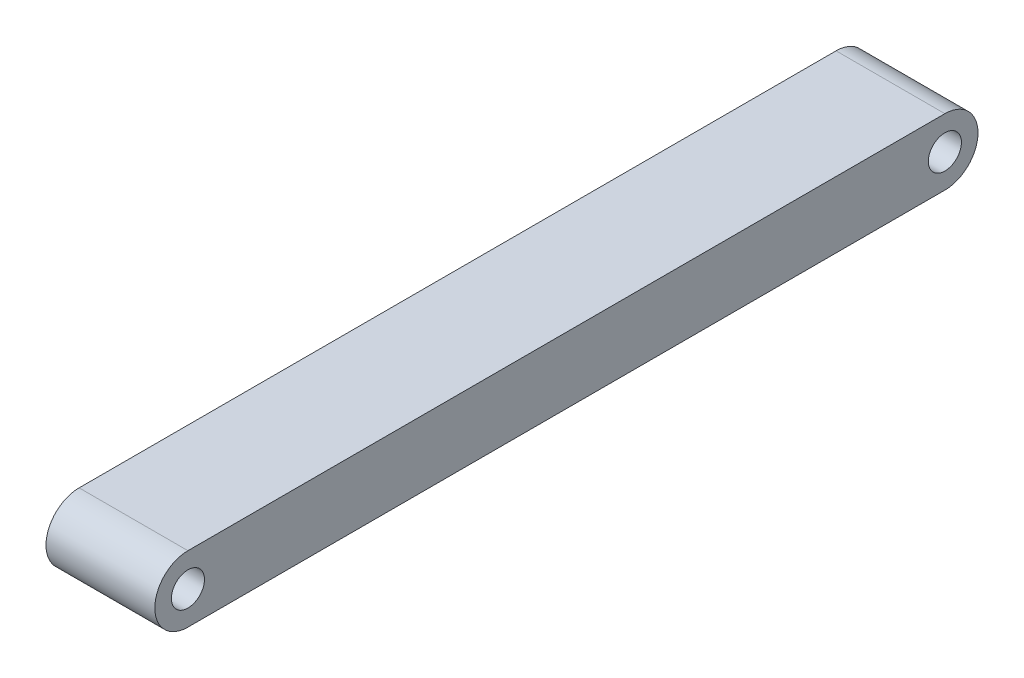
from build123d import *

# Parameters (mm, degrees)
SKETCH1_R           = 17.5
BOSS_EXTRUDE1_DEPTH = 115


with BuildPart() as part:
    # Sketch1 → Boss-Extrude1 (new body)
    with BuildSketch(Plane(origin=(0, 0, 0), x_dir=(0, 0, -1), z_dir=(1, 0, 0))):
        with BuildLine():
            Line((0, 35), (800, 35))
            ThreePointArc((800, 35), (835, 0), (800, -35))
            Line((800, -35), (0, -35))
            ThreePointArc((0, -35), (-35, 0), (0, 35))
        make_face()
        Circle(SKETCH1_R, mode=Mode.SUBTRACT)
        with Locations((800, 0)):
            Circle(SKETCH1_R, mode=Mode.SUBTRACT)
    extrude(amount=BOSS_EXTRUDE1_DEPTH)


solid = part.part
